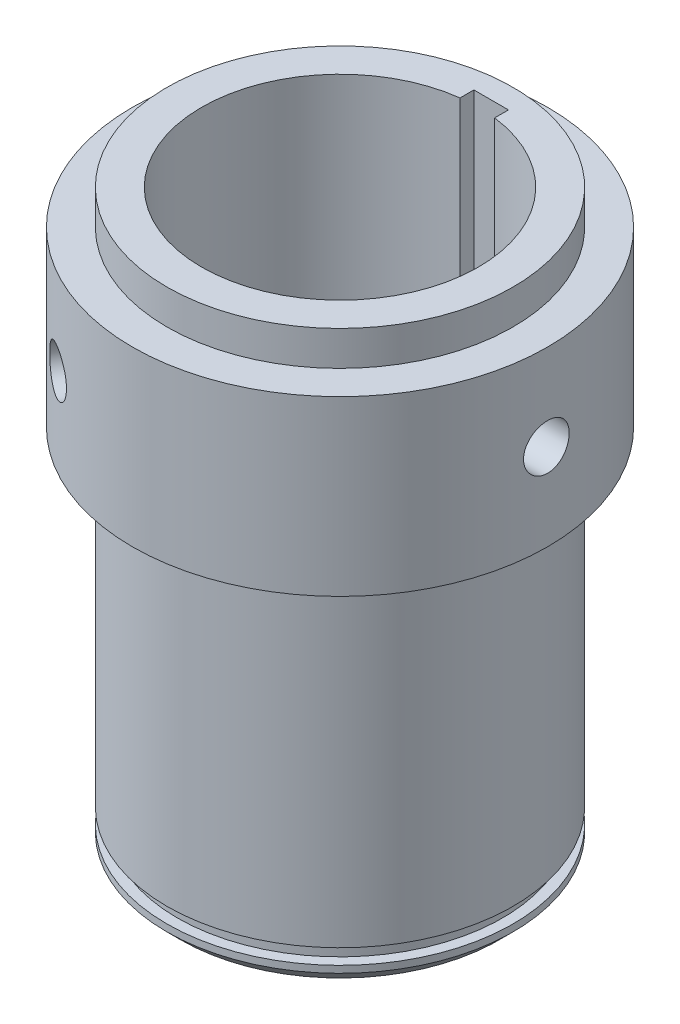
ISO-10303-21;
HEADER;
FILE_DESCRIPTION(('STEP AP214'),'2;1');
FILE_NAME('part.step','',(''),(''),'','','');
FILE_SCHEMA(('AUTOMOTIVE_DESIGN { 1 0 10303 214 1 1 1 1 }'));
ENDSEC;
DATA;
#1=APPLICATION_CONTEXT('core data for automotive mechanical design processes');
#2=APPLICATION_PROTOCOL_DEFINITION('international standard','automotive_design',2000,#1);
#3=PRODUCT_CONTEXT('',#1,'mechanical');
#4=PRODUCT('Part','Part','',(#3));
#5=PRODUCT_RELATED_PRODUCT_CATEGORY('part','',(#4));
#6=PRODUCT_DEFINITION_FORMATION('','',#4);
#7=PRODUCT_DEFINITION_CONTEXT('part definition',#1,'design');
#8=PRODUCT_DEFINITION('design','',#6,#7);
#9=PRODUCT_DEFINITION_SHAPE('','',#8);
#10=(LENGTH_UNIT() NAMED_UNIT(*) SI_UNIT(.MILLI.,.METRE.));
#11=(NAMED_UNIT(*) PLANE_ANGLE_UNIT() SI_UNIT($,.RADIAN.));
#12=(NAMED_UNIT(*) SI_UNIT($,.STERADIAN.) SOLID_ANGLE_UNIT());
#13=UNCERTAINTY_MEASURE_WITH_UNIT(LENGTH_MEASURE(1.E-05),#10,'distance_accuracy_value','');
#14=(GEOMETRIC_REPRESENTATION_CONTEXT(3) GLOBAL_UNCERTAINTY_ASSIGNED_CONTEXT((#13)) GLOBAL_UNIT_ASSIGNED_CONTEXT((#10,
#11,#12)) REPRESENTATION_CONTEXT('',''));
#15=CARTESIAN_POINT('',(0.,0.,0.));
#16=DIRECTION('',(0.,0.,1.));
#17=DIRECTION('',(1.,0.,0.));
#18=AXIS2_PLACEMENT_3D('',#15,#16,#17);
#19=CARTESIAN_POINT('',(25.,-45.9465840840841,0.));
#20=DIRECTION('',(0.,1.,0.));
#21=DIRECTION('',(0.,0.,1.));
#22=AXIS2_PLACEMENT_3D('',#19,#20,#21);
#23=PLANE('',#22);
#24=CARTESIAN_POINT('',(0.,-45.9465840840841,0.));
#25=DIRECTION('',(0.,1.,0.));
#26=DIRECTION('',(0.,0.,1.));
#27=AXIS2_PLACEMENT_3D('',#24,#25,#26);
#28=CIRCLE('',#27,25.);
#29=CARTESIAN_POINT('',(0.,-45.9465840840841,25.));
#30=VERTEX_POINT('',#29);
#31=EDGE_CURVE('E128',#30,#30,#28,.T.);
#32=ORIENTED_EDGE('',*,*,#31,.F.);
#33=EDGE_LOOP('',(#32));
#34=FACE_BOUND('',#33,.T.);
#35=CARTESIAN_POINT('',(0.,-45.9465840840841,0.));
#36=DIRECTION('',(0.,1.,0.));
#37=DIRECTION('',(0.,0.,1.));
#38=AXIS2_PLACEMENT_3D('',#35,#36,#37);
#39=CIRCLE('',#38,23.5);
#40=CARTESIAN_POINT('',(0.,-45.9465840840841,23.5));
#41=VERTEX_POINT('',#40);
#42=EDGE_CURVE('E336',#41,#41,#39,.T.);
#43=ORIENTED_EDGE('',*,*,#42,.T.);
#44=EDGE_LOOP('',(#43));
#45=FACE_BOUND('',#44,.T.);
#46=ADVANCED_FACE('F31',(#34,#45),#23,.F.);
#47=CARTESIAN_POINT('',(0.,69.8663413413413,0.));
#48=DIRECTION('',(0.,1.,0.));
#49=DIRECTION('',(0.,0.,1.));
#50=AXIS2_PLACEMENT_3D('',#47,#48,#49);
#51=CYLINDRICAL_SURFACE('',#50,25.);
#52=CARTESIAN_POINT('',(0.,1.55341591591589,0.));
#53=DIRECTION('',(0.,1.,0.));
#54=DIRECTION('',(0.,0.,1.));
#55=AXIS2_PLACEMENT_3D('',#52,#53,#54);
#56=CIRCLE('',#55,25.);
#57=CARTESIAN_POINT('',(0.,1.55341591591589,25.));
#58=VERTEX_POINT('',#57);
#59=EDGE_CURVE('E125',#58,#58,#56,.T.);
#60=ORIENTED_EDGE('',*,*,#59,.F.);
#61=EDGE_LOOP('',(#60));
#62=FACE_BOUND('',#61,.T.);
#63=ORIENTED_EDGE('',*,*,#31,.T.);
#64=EDGE_LOOP('',(#63));
#65=FACE_BOUND('',#64,.T.);
#66=ADVANCED_FACE('F195',(#62,#65),#51,.T.);
#67=CARTESIAN_POINT('',(25.,1.55341591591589,0.));
#68=DIRECTION('',(0.,1.,0.));
#69=DIRECTION('',(0.,0.,1.));
#70=AXIS2_PLACEMENT_3D('',#67,#68,#69);
#71=PLANE('',#70);
#72=CARTESIAN_POINT('',(0.,1.55341591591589,0.));
#73=DIRECTION('',(0.,1.,0.));
#74=DIRECTION('',(0.,0.,1.));
#75=AXIS2_PLACEMENT_3D('',#72,#73,#74);
#76=CIRCLE('',#75,30.);
#77=CARTESIAN_POINT('',(0.,1.55341591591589,30.));
#78=VERTEX_POINT('',#77);
#79=EDGE_CURVE('E122',#78,#78,#76,.T.);
#80=ORIENTED_EDGE('',*,*,#79,.F.);
#81=EDGE_LOOP('',(#80));
#82=FACE_BOUND('',#81,.T.);
#83=ORIENTED_EDGE('',*,*,#59,.T.);
#84=EDGE_LOOP('',(#83));
#85=FACE_BOUND('',#84,.T.);
#86=ADVANCED_FACE('F190',(#82,#85),#71,.F.);
#87=CARTESIAN_POINT('',(0.,69.8663413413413,0.));
#88=DIRECTION('',(0.,1.,0.));
#89=DIRECTION('',(0.,0.,1.));
#90=AXIS2_PLACEMENT_3D('',#87,#88,#89);
#91=CYLINDRICAL_SURFACE('',#90,30.);
#92=CARTESIAN_POINT('',(-17.7668576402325,14.0534159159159,-24.1731001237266));
#93=CARTESIAN_POINT('',(-17.7668519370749,13.8686560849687,-24.1731061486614));
#94=CARTESIAN_POINT('',(-17.7542425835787,13.6837765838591,-24.1823877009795));
#95=CARTESIAN_POINT('',(-17.7040634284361,13.3191506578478,-24.2191467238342));
#96=CARTESIAN_POINT('',(-17.6664666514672,13.1394099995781,-24.2466438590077));
#97=CARTESIAN_POINT('',(-17.5672126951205,12.7903944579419,-24.3186507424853));
#98=CARTESIAN_POINT('',(-17.5055707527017,12.6211130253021,-24.363149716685));
#99=CARTESIAN_POINT('',(-17.3596823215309,12.2976813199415,-24.4673133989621));
#100=CARTESIAN_POINT('',(-17.275440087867,12.1435282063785,-24.5269752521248));
#101=CARTESIAN_POINT('',(-17.0859462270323,11.8540209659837,-24.6593554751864));
#102=CARTESIAN_POINT('',(-16.9806141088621,11.7187423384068,-24.7321237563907));
#103=CARTESIAN_POINT('',(-16.7516564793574,11.4714750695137,-24.887770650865));
#104=CARTESIAN_POINT('',(-16.6280301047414,11.3594875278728,-24.9706497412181));
#105=CARTESIAN_POINT('',(-16.3651833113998,11.1617161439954,-25.1436981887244));
#106=CARTESIAN_POINT('',(-16.2259239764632,11.0759997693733,-25.2338855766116));
#107=CARTESIAN_POINT('',(-15.9356469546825,10.9336356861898,-25.418195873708));
#108=CARTESIAN_POINT('',(-15.7846296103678,10.8769871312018,-25.5123186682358));
#109=CARTESIAN_POINT('',(-15.47552421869,10.794589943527,-25.7009880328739));
#110=CARTESIAN_POINT('',(-15.3174674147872,10.7687166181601,-25.7955313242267));
#111=CARTESIAN_POINT('',(-14.9981162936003,10.7482182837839,-25.9825082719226));
#112=CARTESIAN_POINT('',(-14.8368220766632,10.753592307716,-26.0749419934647));
#113=CARTESIAN_POINT('',(-14.516338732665,10.7953353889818,-26.2547049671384));
#114=CARTESIAN_POINT('',(-14.3571435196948,10.8315703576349,-26.3420545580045));
#115=CARTESIAN_POINT('',(-14.0448109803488,10.9337975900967,-26.5098988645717));
#116=CARTESIAN_POINT('',(-13.89167374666,10.9997903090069,-26.5903934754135));
#117=CARTESIAN_POINT('',(-13.5957161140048,11.1598051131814,-26.7429300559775));
#118=CARTESIAN_POINT('',(-13.4529181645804,11.2538860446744,-26.8149538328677));
#119=CARTESIAN_POINT('',(-13.1823399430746,11.4673639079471,-26.949002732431));
#120=CARTESIAN_POINT('',(-13.0545602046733,11.5867617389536,-27.0110274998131));
#121=CARTESIAN_POINT('',(-12.8173587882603,11.8482371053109,-27.1243935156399));
#122=CARTESIAN_POINT('',(-12.708037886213,11.9904313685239,-27.1756764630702));
#123=CARTESIAN_POINT('',(-12.5120979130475,12.2930599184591,-27.2664464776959));
#124=CARTESIAN_POINT('',(-12.4254788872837,12.453494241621,-27.305933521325));
#125=CARTESIAN_POINT('',(-12.2777859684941,12.78814356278,-27.3726610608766));
#126=CARTESIAN_POINT('',(-12.2167192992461,12.9623624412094,-27.3998980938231));
#127=CARTESIAN_POINT('',(-12.1222487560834,13.319587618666,-27.4418253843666));
#128=CARTESIAN_POINT('',(-12.0888438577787,13.5025935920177,-27.4565161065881));
#129=CARTESIAN_POINT('',(-12.0509547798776,13.8711737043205,-27.4731673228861));
#130=CARTESIAN_POINT('',(-12.0463203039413,14.0567294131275,-27.4751939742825));
#131=CARTESIAN_POINT('',(-12.0657319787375,14.4260404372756,-27.4666747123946));
#132=CARTESIAN_POINT('',(-12.0897776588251,14.609795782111,-27.4561290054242));
#133=CARTESIAN_POINT('',(-12.1656185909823,14.9698091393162,-27.4226077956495));
#134=CARTESIAN_POINT('',(-12.2173423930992,15.1460852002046,-27.3996642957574));
#135=CARTESIAN_POINT('',(-12.3467464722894,15.4866985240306,-27.3415956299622));
#136=CARTESIAN_POINT('',(-12.4244274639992,15.6510354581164,-27.3064701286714));
#137=CARTESIAN_POINT('',(-12.6035591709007,15.9638476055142,-27.2242540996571));
#138=CARTESIAN_POINT('',(-12.705106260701,16.1122548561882,-27.1771149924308));
#139=CARTESIAN_POINT('',(-12.9285253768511,16.3883041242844,-27.0715433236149));
#140=CARTESIAN_POINT('',(-13.0503980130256,16.5159455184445,-27.0131104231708));
#141=CARTESIAN_POINT('',(-13.311215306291,16.7474066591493,-26.8855476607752));
#142=CARTESIAN_POINT('',(-13.4502323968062,16.8511196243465,-26.8163720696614));
#143=CARTESIAN_POINT('',(-13.7405989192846,17.0310435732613,-26.6687538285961));
#144=CARTESIAN_POINT('',(-13.8919481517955,17.1072550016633,-26.5903113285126));
#145=CARTESIAN_POINT('',(-14.2020318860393,17.2298332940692,-26.4259907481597));
#146=CARTESIAN_POINT('',(-14.3607499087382,17.2762636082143,-26.3401289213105));
#147=CARTESIAN_POINT('',(-14.6811273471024,17.3381685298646,-26.1629125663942));
#148=CARTESIAN_POINT('',(-14.8427866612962,17.3536442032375,-26.0715582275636));
#149=CARTESIAN_POINT('',(-15.163479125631,17.3531837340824,-25.8863479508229));
#150=CARTESIAN_POINT('',(-15.3225216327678,17.3374129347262,-25.7925077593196));
#151=CARTESIAN_POINT('',(-15.6344015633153,17.2752552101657,-25.6046605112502));
#152=CARTESIAN_POINT('',(-15.7872389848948,17.2288682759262,-25.5106534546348));
#153=CARTESIAN_POINT('',(-16.0825711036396,17.1068432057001,-25.3255069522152));
#154=CARTESIAN_POINT('',(-16.2250679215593,17.0312110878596,-25.2343669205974));
#155=CARTESIAN_POINT('',(-16.4960971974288,16.8528598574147,-25.0580316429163));
#156=CARTESIAN_POINT('',(-16.6246296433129,16.7501407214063,-24.9728364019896));
#157=CARTESIAN_POINT('',(-16.8651820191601,16.5199138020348,-24.8110215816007));
#158=CARTESIAN_POINT('',(-16.9771148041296,16.3922828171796,-24.7344477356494));
#159=CARTESIAN_POINT('',(-17.1810152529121,16.1161048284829,-24.5932539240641));
#160=CARTESIAN_POINT('',(-17.2729781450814,15.9675528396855,-24.5286368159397));
#161=CARTESIAN_POINT('',(-17.4349755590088,15.6532472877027,-24.4137573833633));
#162=CARTESIAN_POINT('',(-17.5049429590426,15.4874430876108,-24.3635390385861));
#163=CARTESIAN_POINT('',(-17.6208529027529,15.1438040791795,-24.279841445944));
#164=CARTESIAN_POINT('',(-17.6668221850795,14.9659829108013,-24.2463435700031));
#165=CARTESIAN_POINT('',(-17.7224023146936,14.6648909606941,-24.2057258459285));
#166=CARTESIAN_POINT('',(-17.7390537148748,14.5435361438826,-24.1935149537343));
#167=CARTESIAN_POINT('',(-17.7612832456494,14.2992771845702,-24.177200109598));
#168=CARTESIAN_POINT('',(-17.7668614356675,14.1763730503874,-24.1730961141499));
#169=CARTESIAN_POINT('',(-17.7668576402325,14.0534159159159,-24.1731001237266));
#170=B_SPLINE_CURVE_WITH_KNOTS('',3,(#92,#93,#94,#95,#96,#97,#98,#99,#100,#101,#102,#103,#104,
#105,#106,#107,#108,#109,#110,#111,#112,#113,#114,#115,#116,#117,#118,#119,#120,#121,#122,#123,
#124,#125,#126,#127,#128,#129,#130,#131,#132,#133,#134,#135,#136,#137,#138,#139,#140,#141,#142,
#143,#144,#145,#146,#147,#148,#149,#150,#151,#152,#153,#154,#155,#156,#157,#158,#159,#160,#161,
#162,#163,#164,#165,#166,#167,#168,#169),.UNSPECIFIED.,.T.,.F.,(4,2,2,2,2,2,2,2,2,2,2,2,2,2,2,2,
2,2,2,2,2,2,2,2,2,2,2,2,2,2,2,2,2,2,2,2,2,2,4),(0.,0.553830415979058,1.1082596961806,
1.6623382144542,2.21631248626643,2.77244278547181,3.32859933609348,3.88617242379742,
4.44372927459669,4.99901928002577,5.55429210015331,6.1071645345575,6.66004542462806,
7.21409285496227,7.76815996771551,8.32516051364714,8.88216217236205,9.43932119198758,
9.99645957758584,10.5506850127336,11.1049013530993,11.6576938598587,12.2105015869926,
12.7655811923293,13.3206774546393,13.8782049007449,14.4357233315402,14.992049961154,
15.5483574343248,16.1017290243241,16.6551007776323,17.2083587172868,17.7616171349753,
18.3176843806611,18.8738843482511,19.4317655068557,19.9890237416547,20.3575982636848,
20.7261708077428),.UNSPECIFIED.);
#171=CARTESIAN_POINT('',(-17.7668576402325,14.0534159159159,-24.1731001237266));
#172=VERTEX_POINT('',#171);
#173=EDGE_CURVE('E11',#172,#172,#170,.T.);
#174=ORIENTED_EDGE('',*,*,#173,.T.);
#175=EDGE_LOOP('',(#174));
#176=FACE_BOUND('',#175,.T.);
#177=CARTESIAN_POINT('',(-12.0510899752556,14.0534159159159,27.4731001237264));
#178=CARTESIAN_POINT('',(-12.051098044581,13.8686560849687,27.4730981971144));
#179=CARTESIAN_POINT('',(-12.0654407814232,13.6837765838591,27.4668189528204));
#180=CARTESIAN_POINT('',(-12.1223646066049,13.3191506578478,27.4417420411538));
#181=CARTESIAN_POINT('',(-12.1649762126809,13.1394099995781,27.4229308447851));
#182=CARTESIAN_POINT('',(-12.2769629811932,12.7903944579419,27.3729778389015));
#183=CARTESIAN_POINT('',(-12.3463211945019,12.6211130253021,27.3418438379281));
#184=CARTESIAN_POINT('',(-12.509473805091,12.2976813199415,27.2675825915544));
#185=CARTESIAN_POINT('',(-12.6032636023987,12.1435282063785,27.2244576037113));
#186=CARTESIAN_POINT('',(-12.812655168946,11.8540209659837,27.1265412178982));
#187=CARTESIAN_POINT('',(-12.9283404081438,11.7187423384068,27.0717050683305));
#188=CARTESIAN_POINT('',(-13.1776133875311,11.4714750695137,26.9512453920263));
#189=CARTESIAN_POINT('',(-13.3112019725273,11.3594875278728,26.8856213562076));
#190=CARTESIAN_POINT('',(-13.5924897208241,11.1617161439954,26.7445135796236));
#191=CARTESIAN_POINT('',(-13.7402239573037,11.0759997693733,26.669005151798));
#192=CARTESIAN_POINT('',(-14.0449798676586,10.9336356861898,26.5097730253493));
#193=CARTESIAN_POINT('',(-14.2020012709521,10.8769871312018,26.4260495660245));
#194=CARTESIAN_POINT('',(-14.5199464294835,10.794589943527,26.2526911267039));
#195=CARTESIAN_POINT('',(-14.6808517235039,10.7687166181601,26.1630815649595));
#196=CARTESIAN_POINT('',(-15.002454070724,10.7482182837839,25.9800038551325));
#197=CARTESIAN_POINT('',(-15.1631511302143,10.753592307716,25.8865358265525));
#198=CARTESIAN_POINT('',(-15.4790721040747,10.7953353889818,25.6988705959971));
#199=CARTESIAN_POINT('',(-15.63431667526,10.8315703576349,25.6046782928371));
#200=CARTESIAN_POINT('',(-15.9358403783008,10.9337975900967,25.4181125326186));
#201=CARTESIAN_POINT('',(-16.082119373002,10.9997903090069,25.3257391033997));
#202=CARTESIAN_POINT('',(-16.3621987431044,11.1598051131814,25.1457005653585));
#203=CARTESIAN_POINT('',(-16.49597213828,11.2538860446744,25.0580458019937));
#204=CARTESIAN_POINT('',(-16.7473510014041,11.4673639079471,24.8907426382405));
#205=CARTESIAN_POINT('',(-16.8649558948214,11.5867617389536,24.8110945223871));
#206=CARTESIAN_POINT('',(-17.0817344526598,11.8482371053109,24.6623550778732));
#207=CARTESIAN_POINT('',(-17.1808072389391,11.9904313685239,24.5933218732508));
#208=CARTESIAN_POINT('',(-17.3573863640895,12.2930599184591,24.4690178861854));
#209=CARTESIAN_POINT('',(-17.4348926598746,12.453494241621,24.4137471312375));
#210=CARTESIAN_POINT('',(-17.566526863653,12.78814356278,24.3192050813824));
#211=CARTESIAN_POINT('',(-17.6206481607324,12.9623624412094,24.2799383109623));
#212=CARTESIAN_POINT('',(-17.7041935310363,13.319587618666,24.2190880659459));
#213=CARTESIAN_POINT('',(-17.7336185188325,13.5025935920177,24.197503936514));
#214=CARTESIAN_POINT('',(-17.7669834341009,13.8711737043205,24.1730166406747));
#215=CARTESIAN_POINT('',(-17.771055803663,14.0567294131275,24.1700163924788));
#216=CARTESIAN_POINT('',(-17.7539720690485,14.4260404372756,24.1825677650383));
#217=CARTESIAN_POINT('',(-17.7328163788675,14.609795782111,24.1981190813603));
#218=CARTESIAN_POINT('',(-17.6658656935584,14.9698091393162,24.2470386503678));
#219=CARTESIAN_POINT('',(-17.6201341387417,15.1460852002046,24.2803610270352));
#220=CARTESIAN_POINT('',(-17.5051431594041,15.4866985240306,24.3633939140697));
#221=CARTESIAN_POINT('',(-17.4358830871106,15.6510354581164,24.4131048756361));
#222=CARTESIAN_POINT('',(-17.2751160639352,15.9638476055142,24.527129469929));
#223=CARTESIAN_POINT('',(-17.1835188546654,16.1122548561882,24.5915022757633));
#224=CARTESIAN_POINT('',(-16.9803815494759,16.3883041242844,24.7322030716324));
#225=CARTESIAN_POINT('',(-16.8688408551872,16.5159455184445,24.8085314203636));
#226=CARTESIAN_POINT('',(-16.627959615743,16.7474066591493,24.9706244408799));
#227=CARTESIAN_POINT('',(-16.498543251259,16.8511196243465,25.0564289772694));
#228=CARTESIAN_POINT('',(-16.2255188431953,17.0310435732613,25.2340846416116));
#229=CARTESIAN_POINT('',(-16.0819110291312,17.1072550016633,25.3259356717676));
#230=CARTESIAN_POINT('',(-15.7845633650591,17.2298332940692,25.5123157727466));
#231=CARTESIAN_POINT('',(-15.6308458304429,17.2762636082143,25.6068386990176));
#232=CARTESIAN_POINT('',(-15.3171832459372,17.3381685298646,25.7956855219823));
#233=CARTESIAN_POINT('',(-15.1572384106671,17.3536442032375,25.8900094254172));
#234=CARTESIAN_POINT('',(-14.8364953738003,17.3531837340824,26.075132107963));
#235=CARTESIAN_POINT('',(-14.6757061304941,17.3374129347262,26.1659468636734));
#236=CARTESIAN_POINT('',(-14.3570856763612,17.2752552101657,26.3421191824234));
#237=CARTESIAN_POINT('',(-14.1992544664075,17.2288682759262,26.4274767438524));
#238=CARTESIAN_POINT('',(-13.8912468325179,17.1068432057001,26.5906686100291));
#239=CARTESIAN_POINT('',(-13.7410688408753,17.0312110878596,26.6685044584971));
#240=CARTESIAN_POINT('',(-13.4528433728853,16.8528598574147,26.8150550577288));
#241=CARTESIAN_POINT('',(-13.3147959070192,16.7501407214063,26.8837698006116));
#242=CARTESIAN_POINT('',(-13.05438397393,16.5199138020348,27.0111868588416));
#243=CARTESIAN_POINT('',(-12.9321026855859,16.3922828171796,27.0698365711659));
#244=CARTESIAN_POINT('',(-12.7078750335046,16.1161048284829,27.1758226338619));
#245=CARTESIAN_POINT('',(-12.6059335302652,15.9675528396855,27.2231562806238));
#246=CARTESIAN_POINT('',(-12.425446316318,15.6532472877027,27.3060104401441));
#247=CARTESIAN_POINT('',(-12.346972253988,15.4874430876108,27.3414948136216));
#248=CARTESIAN_POINT('',(-12.2165330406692,15.1438040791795,27.4000269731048));
#249=CARTESIAN_POINT('',(-12.1645383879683,14.9659829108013,27.4230886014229));
#250=CARTESIAN_POINT('',(-12.1015723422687,14.6648909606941,27.4509135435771));
#251=CARTESIAN_POINT('',(-12.0826716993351,14.5435361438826,27.4592286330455));
#252=CARTESIAN_POINT('',(-12.0574278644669,14.2992771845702,27.4703225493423));
#253=CARTESIAN_POINT('',(-12.0510846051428,14.1763730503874,27.4731014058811));
#254=CARTESIAN_POINT('',(-12.0510899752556,14.0534159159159,27.4731001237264));
#255=B_SPLINE_CURVE_WITH_KNOTS('',3,(#177,#178,#179,#180,#181,#182,#183,#184,#185,#186,#187,
#188,#189,#190,#191,#192,#193,#194,#195,#196,#197,#198,#199,#200,#201,#202,#203,#204,#205,#206,
#207,#208,#209,#210,#211,#212,#213,#214,#215,#216,#217,#218,#219,#220,#221,#222,#223,#224,#225,
#226,#227,#228,#229,#230,#231,#232,#233,#234,#235,#236,#237,#238,#239,#240,#241,#242,#243,#244,
#245,#246,#247,#248,#249,#250,#251,#252,#253,#254),.UNSPECIFIED.,.T.,.F.,(4,2,2,2,2,2,2,2,2,2,2,
2,2,2,2,2,2,2,2,2,2,2,2,2,2,2,2,2,2,2,2,2,2,2,2,2,2,2,4),(0.,0.553830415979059,1.1082596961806,
1.6623382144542,2.21631248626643,2.77244278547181,3.32859933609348,3.88617242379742,
4.44372927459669,4.99901928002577,5.55429210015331,6.1071645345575,6.66004542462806,
7.21409285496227,7.76815996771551,8.32516051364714,8.88216217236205,9.43932119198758,
9.99645957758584,10.5506850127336,11.1049013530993,11.6576938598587,12.2105015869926,
12.7655811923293,13.3206774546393,13.8782049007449,14.4357233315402,14.992049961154,
15.5483574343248,16.1017290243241,16.6551007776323,17.2083587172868,17.7616171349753,
18.3176843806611,18.8738843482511,19.4317655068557,19.9890237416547,20.3575982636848,
20.7261708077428),.UNSPECIFIED.);
#256=CARTESIAN_POINT('',(-12.0510899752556,14.0534159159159,27.4731001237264));
#257=VERTEX_POINT('',#256);
#258=EDGE_CURVE('E43',#257,#257,#255,.T.);
#259=ORIENTED_EDGE('',*,*,#258,.T.);
#260=EDGE_LOOP('',(#259));
#261=FACE_BOUND('',#260,.T.);
#262=CARTESIAN_POINT('',(29.8179476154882,14.0534159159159,-3.29999999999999));
#263=CARTESIAN_POINT('',(29.817949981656,13.8686560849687,-3.29999204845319));
#264=CARTESIAN_POINT('',(29.819683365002,13.6837765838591,-3.28443125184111));
#265=CARTESIAN_POINT('',(29.8264280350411,13.3191506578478,-3.22259531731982));
#266=CARTESIAN_POINT('',(29.8314428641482,13.1394099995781,-3.17628698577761));
#267=CARTESIAN_POINT('',(29.8441756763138,12.7903944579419,-3.05432709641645));
#268=CARTESIAN_POINT('',(29.8518919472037,12.6211130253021,-2.97869412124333));
#269=CARTESIAN_POINT('',(29.8691561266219,12.2976813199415,-2.80026919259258));
#270=CARTESIAN_POINT('',(29.8787036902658,12.1435282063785,-2.69748235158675));
#271=CARTESIAN_POINT('',(29.8986013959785,11.8540209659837,-2.46718574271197));
#272=CARTESIAN_POINT('',(29.908954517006,11.7187423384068,-2.33958131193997));
#273=CARTESIAN_POINT('',(29.9292698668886,11.4714750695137,-2.06347474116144));
#274=CARTESIAN_POINT('',(29.9392320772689,11.3594875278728,-1.91497161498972));
#275=CARTESIAN_POINT('',(29.957673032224,11.1617161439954,-1.60081539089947));
#276=CARTESIAN_POINT('',(29.9661479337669,11.0759997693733,-1.43511957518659));
#277=CARTESIAN_POINT('',(29.9806268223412,10.9336356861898,-1.09157715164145));
#278=CARTESIAN_POINT('',(29.98663088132,10.8769871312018,-0.913730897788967));
#279=CARTESIAN_POINT('',(29.9954706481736,10.794589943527,-0.551703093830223));
#280=CARTESIAN_POINT('',(29.9983191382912,10.7687166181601,-0.367550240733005));
#281=CARTESIAN_POINT('',(30.0005703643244,10.7482182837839,0.00250441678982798));
#282=CARTESIAN_POINT('',(29.9999732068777,10.753592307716,0.188406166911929));
#283=CARTESIAN_POINT('',(29.9954108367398,10.7953353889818,0.555834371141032));
#284=CARTESIAN_POINT('',(29.9914601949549,10.8315703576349,0.737376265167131));
#285=CARTESIAN_POINT('',(29.9806513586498,10.9337975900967,1.09178633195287));
#286=CARTESIAN_POINT('',(29.9737931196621,10.9997903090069,1.2646543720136));
#287=CARTESIAN_POINT('',(29.9579148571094,11.1598051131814,1.59722949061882));
#288=CARTESIAN_POINT('',(29.9488903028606,11.2538860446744,1.75690803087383));
#289=CARTESIAN_POINT('',(29.9296909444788,11.4673639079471,2.05826009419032));
#290=CARTESIAN_POINT('',(29.9195160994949,11.5867617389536,2.19993297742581));
#291=CARTESIAN_POINT('',(29.8990932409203,11.8482371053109,2.46203843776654));
#292=CARTESIAN_POINT('',(29.8888451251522,11.9904313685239,2.5823545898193));
#293=CARTESIAN_POINT('',(29.8694842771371,12.2930599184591,2.79742859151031));
#294=CARTESIAN_POINT('',(29.8603715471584,12.453494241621,2.89218639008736));
#295=CARTESIAN_POINT('',(29.8443128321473,12.78814356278,3.05345597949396));
#296=CARTESIAN_POINT('',(29.8373674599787,12.9623624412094,3.11995978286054));
#297=CARTESIAN_POINT('',(29.8264422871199,13.319587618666,3.22273731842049));
#298=CARTESIAN_POINT('',(29.8224623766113,13.5025935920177,3.25901217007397));
#299=CARTESIAN_POINT('',(29.8179382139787,13.8711737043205,3.30015068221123));
#300=CARTESIAN_POINT('',(29.8173761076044,14.0567294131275,3.30517758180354));
#301=CARTESIAN_POINT('',(29.8197040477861,14.4260404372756,3.28410694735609));
#302=CARTESIAN_POINT('',(29.8225940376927,14.609795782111,3.25800992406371));
#303=CARTESIAN_POINT('',(29.8314842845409,14.9698091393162,3.17556914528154));
#304=CARTESIAN_POINT('',(29.837476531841,15.1460852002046,3.11930326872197));
#305=CARTESIAN_POINT('',(29.8518896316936,15.4866985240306,2.9782017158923));
#306=CARTESIAN_POINT('',(29.8603105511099,15.6510354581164,2.89336525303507));
#307=CARTESIAN_POINT('',(29.8786752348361,15.9638476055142,2.69712462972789));
#308=CARTESIAN_POINT('',(29.8886251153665,16.1122548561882,2.58561271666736));
#309=CARTESIAN_POINT('',(29.9089069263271,16.3883041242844,2.33934025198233));
#310=CARTESIAN_POINT('',(29.9192388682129,16.5159455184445,2.20457900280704));
#311=CARTESIAN_POINT('',(29.9391749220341,16.7474066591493,1.91492321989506));
#312=CARTESIAN_POINT('',(29.9487756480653,16.8511196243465,1.75994309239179));
#313=CARTESIAN_POINT('',(29.9661177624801,17.0310435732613,1.43466918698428));
#314=CARTESIAN_POINT('',(29.9738591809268,17.1072550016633,1.2643756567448));
#315=CARTESIAN_POINT('',(29.9865952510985,17.2298332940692,0.913674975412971));
#316=CARTESIAN_POINT('',(29.9915957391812,17.2762636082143,0.73329022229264));
#317=CARTESIAN_POINT('',(29.9983105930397,17.3381685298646,0.367227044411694));
#318=CARTESIAN_POINT('',(30.0000250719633,17.3536442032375,0.181548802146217));
#319=CARTESIAN_POINT('',(29.9999744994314,17.3531837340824,-0.188784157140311));
#320=CARTESIAN_POINT('',(29.9982277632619,17.3374129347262,-0.373439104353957));
#321=CARTESIAN_POINT('',(29.9914872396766,17.2752552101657,-0.737458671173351));
#322=CARTESIAN_POINT('',(29.9864934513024,17.2288682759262,-0.916823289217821));
#323=CARTESIAN_POINT('',(29.9738179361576,17.1068432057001,-1.26516165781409));
#324=CARTESIAN_POINT('',(29.9661367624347,17.0312110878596,-1.43413753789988));
#325=CARTESIAN_POINT('',(29.9489405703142,16.8528598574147,-1.75702341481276));
#326=CARTESIAN_POINT('',(29.9394255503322,16.7501407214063,-1.91093339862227));
#327=CARTESIAN_POINT('',(29.9195659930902,16.5199138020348,-2.20016527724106));
#328=CARTESIAN_POINT('',(29.9092174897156,16.3922828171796,-2.33538883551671));
#329=CARTESIAN_POINT('',(29.8888902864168,16.1161048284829,-2.58256870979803));
#330=CARTESIAN_POINT('',(29.8789116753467,15.9675528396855,-2.69451946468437));
#331=CARTESIAN_POINT('',(29.8604218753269,15.6532472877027,-2.89225305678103));
#332=CARTESIAN_POINT('',(29.8519152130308,15.4874430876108,-2.9779557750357));
#333=CARTESIAN_POINT('',(29.8373859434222,15.1438040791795,-3.12018552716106));
#334=CARTESIAN_POINT('',(29.8313605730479,14.9659829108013,-3.17674503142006));
#335=CARTESIAN_POINT('',(29.8239746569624,14.6648909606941,-3.24518769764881));
#336=CARTESIAN_POINT('',(29.82172541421,14.5435361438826,-3.26571367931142));
#337=CARTESIAN_POINT('',(29.8187111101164,14.2992771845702,-3.29312243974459));
#338=CARTESIAN_POINT('',(29.8179460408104,14.1763730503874,-3.30000529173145));
#339=CARTESIAN_POINT('',(29.8179476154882,14.0534159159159,-3.29999999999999));
#340=B_SPLINE_CURVE_WITH_KNOTS('',3,(#262,#263,#264,#265,#266,#267,#268,#269,#270,#271,#272,
#273,#274,#275,#276,#277,#278,#279,#280,#281,#282,#283,#284,#285,#286,#287,#288,#289,#290,#291,
#292,#293,#294,#295,#296,#297,#298,#299,#300,#301,#302,#303,#304,#305,#306,#307,#308,#309,#310,
#311,#312,#313,#314,#315,#316,#317,#318,#319,#320,#321,#322,#323,#324,#325,#326,#327,#328,#329,
#330,#331,#332,#333,#334,#335,#336,#337,#338,#339),.UNSPECIFIED.,.T.,.F.,(4,2,2,2,2,2,2,2,2,2,2,
2,2,2,2,2,2,2,2,2,2,2,2,2,2,2,2,2,2,2,2,2,2,2,2,2,2,2,4),(0.,0.553830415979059,1.1082596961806,
1.6623382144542,2.21631248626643,2.77244278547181,3.32859933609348,3.88617242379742,
4.44372927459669,4.99901928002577,5.55429210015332,6.1071645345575,6.66004542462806,
7.21409285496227,7.76815996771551,8.32516051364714,8.88216217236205,9.43932119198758,
9.99645957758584,10.5506850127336,11.1049013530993,11.6576938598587,12.2105015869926,
12.7655811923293,13.3206774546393,13.8782049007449,14.4357233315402,14.992049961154,
15.5483574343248,16.1017290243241,16.6551007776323,17.2083587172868,17.7616171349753,
18.3176843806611,18.8738843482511,19.4317655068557,19.9890237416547,20.3575982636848,
20.7261708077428),.UNSPECIFIED.);
#341=CARTESIAN_POINT('',(29.8179476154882,14.0534159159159,-3.29999999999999));
#342=VERTEX_POINT('',#341);
#343=EDGE_CURVE('E137',#342,#342,#340,.T.);
#344=ORIENTED_EDGE('',*,*,#343,.T.);
#345=EDGE_LOOP('',(#344));
#346=FACE_BOUND('',#345,.T.);
#347=CARTESIAN_POINT('',(0.,26.5534159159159,0.));
#348=DIRECTION('',(0.,1.,0.));
#349=DIRECTION('',(0.,0.,1.));
#350=AXIS2_PLACEMENT_3D('',#347,#348,#349);
#351=CIRCLE('',#350,30.);
#352=CARTESIAN_POINT('',(0.,26.5534159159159,30.));
#353=VERTEX_POINT('',#352);
#354=EDGE_CURVE('E119',#353,#353,#351,.T.);
#355=ORIENTED_EDGE('',*,*,#354,.F.);
#356=EDGE_LOOP('',(#355));
#357=FACE_BOUND('',#356,.T.);
#358=ORIENTED_EDGE('',*,*,#79,.T.);
#359=EDGE_LOOP('',(#358));
#360=FACE_BOUND('',#359,.T.);
#361=ADVANCED_FACE('F145',(#176,#261,#346,#357,#360),#91,.T.);
#362=CARTESIAN_POINT('',(30.,26.5534159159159,0.));
#363=DIRECTION('',(0.,-1.,0.));
#364=DIRECTION('',(0.,0.,-1.));
#365=AXIS2_PLACEMENT_3D('',#362,#363,#364);
#366=PLANE('',#365);
#367=CARTESIAN_POINT('',(0.,26.5534159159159,0.));
#368=DIRECTION('',(0.,1.,0.));
#369=DIRECTION('',(0.,0.,1.));
#370=AXIS2_PLACEMENT_3D('',#367,#368,#369);
#371=CIRCLE('',#370,25.);
#372=CARTESIAN_POINT('',(0.,26.5534159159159,25.));
#373=VERTEX_POINT('',#372);
#374=EDGE_CURVE('E116',#373,#373,#371,.T.);
#375=ORIENTED_EDGE('',*,*,#374,.F.);
#376=EDGE_LOOP('',(#375));
#377=FACE_BOUND('',#376,.T.);
#378=ORIENTED_EDGE('',*,*,#354,.T.);
#379=EDGE_LOOP('',(#378));
#380=FACE_BOUND('',#379,.T.);
#381=ADVANCED_FACE('F183',(#377,#380),#366,.F.);
#382=CARTESIAN_POINT('',(0.,69.8663413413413,0.));
#383=DIRECTION('',(0.,1.,0.));
#384=DIRECTION('',(0.,0.,1.));
#385=AXIS2_PLACEMENT_3D('',#382,#383,#384);
#386=CYLINDRICAL_SURFACE('',#385,25.);
#387=CARTESIAN_POINT('',(0.,31.5534159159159,0.));
#388=DIRECTION('',(0.,1.,0.));
#389=DIRECTION('',(0.,0.,1.));
#390=AXIS2_PLACEMENT_3D('',#387,#388,#389);
#391=CIRCLE('',#390,25.);
#392=CARTESIAN_POINT('',(0.,31.5534159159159,25.));
#393=VERTEX_POINT('',#392);
#394=EDGE_CURVE('E107',#393,#393,#391,.T.);
#395=ORIENTED_EDGE('',*,*,#394,.F.);
#396=EDGE_LOOP('',(#395));
#397=FACE_BOUND('',#396,.T.);
#398=ORIENTED_EDGE('',*,*,#374,.T.);
#399=EDGE_LOOP('',(#398));
#400=FACE_BOUND('',#399,.T.);
#401=ADVANCED_FACE('F180',(#397,#400),#386,.T.);
#402=CARTESIAN_POINT('',(25.,31.5534159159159,0.));
#403=DIRECTION('',(0.,-1.,0.));
#404=DIRECTION('',(0.,0.,-1.));
#405=AXIS2_PLACEMENT_3D('',#402,#403,#404);
#406=PLANE('',#405);
#407=CARTESIAN_POINT('',(0.,31.5534159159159,0.));
#408=DIRECTION('',(0.,1.,0.));
#409=DIRECTION('',(0.,0.,1.));
#410=AXIS2_PLACEMENT_3D('',#407,#408,#409);
#411=CIRCLE('',#410,20.);
#412=CARTESIAN_POINT('',(-2.5,31.5534159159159,-19.8431348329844));
#413=VERTEX_POINT('',#412);
#414=CARTESIAN_POINT('',(2.5,31.5534159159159,-19.8431348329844));
#415=VERTEX_POINT('',#414);
#416=EDGE_CURVE('E104',#413,#415,#411,.T.);
#417=ORIENTED_EDGE('',*,*,#416,.F.);
#418=DIRECTION('',(0.,0.,1.));
#419=VECTOR('',#418,1.);
#420=CARTESIAN_POINT('',(-2.5,31.5534159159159,-19.8431348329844));
#421=LINE('',#420,#419);
#422=CARTESIAN_POINT('',(-2.5,31.5534159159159,-21.8431348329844));
#423=VERTEX_POINT('',#422);
#424=EDGE_CURVE('E87',#423,#413,#421,.T.);
#425=ORIENTED_EDGE('',*,*,#424,.F.);
#426=DIRECTION('',(-1.,0.,0.));
#427=VECTOR('',#426,1.);
#428=CARTESIAN_POINT('',(-2.5,31.5534159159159,-21.8431348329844));
#429=LINE('',#428,#427);
#430=CARTESIAN_POINT('',(2.5,31.5534159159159,-21.8431348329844));
#431=VERTEX_POINT('',#430);
#432=EDGE_CURVE('E100',#431,#423,#429,.T.);
#433=ORIENTED_EDGE('',*,*,#432,.F.);
#434=DIRECTION('',(0.,0.,-1.));
#435=VECTOR('',#434,1.);
#436=CARTESIAN_POINT('',(2.5,31.5534159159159,-19.8431348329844));
#437=LINE('',#436,#435);
#438=EDGE_CURVE('E314',#415,#431,#437,.T.);
#439=ORIENTED_EDGE('',*,*,#438,.F.);
#440=EDGE_LOOP('',(#417,#425,#433,#439));
#441=FACE_BOUND('',#440,.T.);
#442=ORIENTED_EDGE('',*,*,#394,.T.);
#443=EDGE_LOOP('',(#442));
#444=FACE_BOUND('',#443,.T.);
#445=ADVANCED_FACE('F177',(#441,#444),#406,.F.);
#446=CARTESIAN_POINT('',(0.,69.8663413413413,0.));
#447=DIRECTION('',(0.,1.,0.));
#448=DIRECTION('',(0.,0.,1.));
#449=AXIS2_PLACEMENT_3D('',#446,#447,#448);
#450=CYLINDRICAL_SURFACE('',#449,20.);
#451=ORIENTED_EDGE('',*,*,#416,.T.);
#452=DIRECTION('',(0.,1.,0.));
#453=VECTOR('',#452,1.);
#454=CARTESIAN_POINT('',(2.5,-51.1465840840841,-19.8431348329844));
#455=LINE('',#454,#453);
#456=CARTESIAN_POINT('',(2.5,-51.1465840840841,-19.8431348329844));
#457=VERTEX_POINT('',#456);
#458=EDGE_CURVE('E92',#457,#415,#455,.T.);
#459=ORIENTED_EDGE('',*,*,#458,.F.);
#460=CARTESIAN_POINT('',(0.,-51.1465840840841,0.));
#461=DIRECTION('',(0.,1.,0.));
#462=DIRECTION('',(0.,0.,1.));
#463=AXIS2_PLACEMENT_3D('',#460,#461,#462);
#464=CIRCLE('',#463,20.);
#465=CARTESIAN_POINT('',(-2.5,-51.1465840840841,-19.8431348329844));
#466=VERTEX_POINT('',#465);
#467=EDGE_CURVE('E98',#466,#457,#464,.T.);
#468=ORIENTED_EDGE('',*,*,#467,.F.);
#469=DIRECTION('',(0.,1.,0.));
#470=VECTOR('',#469,1.);
#471=CARTESIAN_POINT('',(-2.5,-51.1465840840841,-19.8431348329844));
#472=LINE('',#471,#470);
#473=EDGE_CURVE('E82',#466,#413,#472,.T.);
#474=ORIENTED_EDGE('',*,*,#473,.T.);
#475=EDGE_LOOP('',(#451,#459,#468,#474));
#476=FACE_BOUND('',#475,.T.);
#477=ADVANCED_FACE('F103',(#476),#450,.F.);
#478=CARTESIAN_POINT('',(20.,-51.1465840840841,0.));
#479=DIRECTION('',(0.,1.,0.));
#480=DIRECTION('',(0.,0.,1.));
#481=AXIS2_PLACEMENT_3D('',#478,#479,#480);
#482=PLANE('',#481);
#483=CARTESIAN_POINT('',(0.,-51.1465840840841,0.));
#484=DIRECTION('',(0.,1.,0.));
#485=DIRECTION('',(0.,0.,1.));
#486=AXIS2_PLACEMENT_3D('',#483,#484,#485);
#487=CIRCLE('',#486,23.);
#488=CARTESIAN_POINT('',(0.,-51.1465840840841,23.));
#489=VERTEX_POINT('',#488);
#490=EDGE_CURVE('E134',#489,#489,#487,.F.);
#491=ORIENTED_EDGE('',*,*,#490,.T.);
#492=EDGE_LOOP('',(#491));
#493=FACE_BOUND('',#492,.T.);
#494=DIRECTION('',(-1.,0.,0.));
#495=VECTOR('',#494,1.);
#496=CARTESIAN_POINT('',(-2.5,-51.1465840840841,-21.8431348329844));
#497=LINE('',#496,#495);
#498=CARTESIAN_POINT('',(2.5,-51.1465840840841,-21.8431348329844));
#499=VERTEX_POINT('',#498);
#500=CARTESIAN_POINT('',(-2.5,-51.1465840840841,-21.8431348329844));
#501=VERTEX_POINT('',#500);
#502=EDGE_CURVE('E50',#499,#501,#497,.T.);
#503=ORIENTED_EDGE('',*,*,#502,.T.);
#504=DIRECTION('',(0.,0.,1.));
#505=VECTOR('',#504,1.);
#506=CARTESIAN_POINT('',(-2.5,-51.1465840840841,-19.8431348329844));
#507=LINE('',#506,#505);
#508=EDGE_CURVE('E85',#501,#466,#507,.T.);
#509=ORIENTED_EDGE('',*,*,#508,.T.);
#510=ORIENTED_EDGE('',*,*,#467,.T.);
#511=DIRECTION('',(0.,0.,-1.));
#512=VECTOR('',#511,1.);
#513=CARTESIAN_POINT('',(2.5,-51.1465840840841,-19.8431348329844));
#514=LINE('',#513,#512);
#515=EDGE_CURVE('E99',#457,#499,#514,.T.);
#516=ORIENTED_EDGE('',*,*,#515,.T.);
#517=EDGE_LOOP('',(#503,#509,#510,#516));
#518=FACE_BOUND('',#517,.T.);
#519=ADVANCED_FACE('F96',(#493,#518),#482,.F.);
#520=CARTESIAN_POINT('',(0.,69.8663413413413,0.));
#521=DIRECTION('',(0.,1.,0.));
#522=DIRECTION('',(0.,0.,1.));
#523=AXIS2_PLACEMENT_3D('',#520,#521,#522);
#524=CYLINDRICAL_SURFACE('',#523,25.);
#525=CARTESIAN_POINT('',(0.,-49.1465840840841,0.));
#526=DIRECTION('',(0.,1.,0.));
#527=DIRECTION('',(0.,0.,1.));
#528=AXIS2_PLACEMENT_3D('',#525,#526,#527);
#529=CIRCLE('',#528,25.);
#530=CARTESIAN_POINT('',(0.,-49.1465840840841,25.));
#531=VERTEX_POINT('',#530);
#532=EDGE_CURVE('E131',#531,#531,#529,.T.);
#533=ORIENTED_EDGE('',*,*,#532,.T.);
#534=EDGE_LOOP('',(#533));
#535=FACE_BOUND('',#534,.T.);
#536=CARTESIAN_POINT('',(0.,-48.1465840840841,0.));
#537=DIRECTION('',(0.,1.,0.));
#538=DIRECTION('',(0.,0.,1.));
#539=AXIS2_PLACEMENT_3D('',#536,#537,#538);
#540=CIRCLE('',#539,25.);
#541=CARTESIAN_POINT('',(0.,-48.1465840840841,25.));
#542=VERTEX_POINT('',#541);
#543=EDGE_CURVE('E105',#542,#542,#540,.T.);
#544=ORIENTED_EDGE('',*,*,#543,.F.);
#545=EDGE_LOOP('',(#544));
#546=FACE_BOUND('',#545,.T.);
#547=ADVANCED_FACE('F167',(#535,#546),#524,.T.);
#548=CARTESIAN_POINT('',(23.5,-48.1465840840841,0.));
#549=DIRECTION('',(0.,-1.,0.));
#550=DIRECTION('',(0.,0.,-1.));
#551=AXIS2_PLACEMENT_3D('',#548,#549,#550);
#552=PLANE('',#551);
#553=CARTESIAN_POINT('',(0.,-48.1465840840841,0.));
#554=DIRECTION('',(0.,1.,0.));
#555=DIRECTION('',(0.,0.,1.));
#556=AXIS2_PLACEMENT_3D('',#553,#554,#555);
#557=CIRCLE('',#556,23.5);
#558=CARTESIAN_POINT('',(0.,-48.1465840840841,23.5));
#559=VERTEX_POINT('',#558);
#560=EDGE_CURVE('E110',#559,#559,#557,.T.);
#561=ORIENTED_EDGE('',*,*,#560,.F.);
#562=EDGE_LOOP('',(#561));
#563=FACE_BOUND('',#562,.T.);
#564=ORIENTED_EDGE('',*,*,#543,.T.);
#565=EDGE_LOOP('',(#564));
#566=FACE_BOUND('',#565,.T.);
#567=ADVANCED_FACE('F163',(#563,#566),#552,.F.);
#568=CARTESIAN_POINT('',(0.,69.8663413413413,0.));
#569=DIRECTION('',(0.,1.,0.));
#570=DIRECTION('',(0.,0.,1.));
#571=AXIS2_PLACEMENT_3D('',#568,#569,#570);
#572=CYLINDRICAL_SURFACE('',#571,23.5);
#573=ORIENTED_EDGE('',*,*,#42,.F.);
#574=EDGE_LOOP('',(#573));
#575=FACE_BOUND('',#574,.T.);
#576=ORIENTED_EDGE('',*,*,#560,.T.);
#577=EDGE_LOOP('',(#576));
#578=FACE_BOUND('',#577,.T.);
#579=ADVANCED_FACE('F160',(#575,#578),#572,.T.);
#580=CARTESIAN_POINT('',(0.,-49.1465840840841,0.));
#581=DIRECTION('',(0.,1.,0.));
#582=DIRECTION('',(0.,0.,1.));
#583=AXIS2_PLACEMENT_3D('',#580,#581,#582);
#584=CONICAL_SURFACE('',#583,25.,0.785398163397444);
#585=ORIENTED_EDGE('',*,*,#490,.F.);
#586=EDGE_LOOP('',(#585));
#587=FACE_BOUND('',#586,.T.);
#588=ORIENTED_EDGE('',*,*,#532,.F.);
#589=EDGE_LOOP('',(#588));
#590=FACE_BOUND('',#589,.T.);
#591=ADVANCED_FACE('F33',(#587,#590),#584,.T.);
#592=CARTESIAN_POINT('',(30.,14.0534159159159,0.));
#593=DIRECTION('',(1.,0.,0.));
#594=DIRECTION('',(0.,0.,-1.));
#595=AXIS2_PLACEMENT_3D('',#592,#593,#594);
#596=CYLINDRICAL_SURFACE('',#595,3.29999999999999);
#597=CARTESIAN_POINT('',(23.,14.0534159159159,0.));
#598=DIRECTION('',(1.,0.,0.));
#599=DIRECTION('',(0.,0.,-1.));
#600=AXIS2_PLACEMENT_3D('',#597,#598,#599);
#601=CIRCLE('',#600,3.3);
#602=CARTESIAN_POINT('',(23.,14.0534159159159,-3.3));
#603=VERTEX_POINT('',#602);
#604=EDGE_CURVE('E333',#603,#603,#601,.T.);
#605=ORIENTED_EDGE('',*,*,#604,.F.);
#606=EDGE_LOOP('',(#605));
#607=FACE_BOUND('',#606,.T.);
#608=ORIENTED_EDGE('',*,*,#343,.F.);
#609=EDGE_LOOP('',(#608));
#610=FACE_BOUND('',#609,.T.);
#611=ADVANCED_FACE('F149',(#607,#610),#596,.F.);
#612=CARTESIAN_POINT('',(23.,14.0534159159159,0.));
#613=DIRECTION('',(1.,0.,0.));
#614=DIRECTION('',(0.,0.,-1.));
#615=AXIS2_PLACEMENT_3D('',#612,#613,#614);
#616=CONICAL_SURFACE('',#615,3.3,1.02974425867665);
#617=CARTESIAN_POINT('',(21.0171599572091,14.0534159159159,0.));
#618=VERTEX_POINT('',#617);
#619=VERTEX_LOOP('',#618);
#620=FACE_BOUND('',#619,.T.);
#621=ORIENTED_EDGE('',*,*,#604,.T.);
#622=EDGE_LOOP('',(#621));
#623=FACE_BOUND('',#622,.T.);
#624=ADVANCED_FACE('F154',(#620,#623),#616,.F.);
#625=CARTESIAN_POINT('',(-15.0000000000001,14.0534159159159,25.9807621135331));
#626=DIRECTION('',(-0.500000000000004,0.,0.866025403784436));
#627=DIRECTION('',(0.866025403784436,0.,0.500000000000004));
#628=AXIS2_PLACEMENT_3D('',#625,#626,#627);
#629=CYLINDRICAL_SURFACE('',#628,3.29999999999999);
#630=CARTESIAN_POINT('',(-11.5000000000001,14.0534159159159,19.918584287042));
#631=DIRECTION('',(-0.500000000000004,0.,0.866025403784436));
#632=DIRECTION('',(0.866025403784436,0.,0.500000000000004));
#633=AXIS2_PLACEMENT_3D('',#630,#631,#632);
#634=CIRCLE('',#633,3.3);
#635=CARTESIAN_POINT('',(-8.64211616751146,14.0534159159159,21.5685842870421));
#636=VERTEX_POINT('',#635);
#637=EDGE_CURVE('E330',#636,#636,#634,.T.);
#638=ORIENTED_EDGE('',*,*,#637,.F.);
#639=EDGE_LOOP('',(#638));
#640=FACE_BOUND('',#639,.T.);
#641=ORIENTED_EDGE('',*,*,#258,.F.);
#642=EDGE_LOOP('',(#641));
#643=FACE_BOUND('',#642,.T.);
#644=ADVANCED_FACE('F159',(#640,#643),#629,.F.);
#645=CARTESIAN_POINT('',(-11.5000000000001,14.0534159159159,19.918584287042));
#646=DIRECTION('',(-0.500000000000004,0.,0.866025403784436));
#647=DIRECTION('',(0.866025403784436,0.,0.500000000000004));
#648=AXIS2_PLACEMENT_3D('',#645,#646,#647);
#649=CONICAL_SURFACE('',#648,3.3,1.02974425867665);
#650=CARTESIAN_POINT('',(-10.5085799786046,14.0534159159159,18.2013944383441));
#651=VERTEX_POINT('',#650);
#652=VERTEX_LOOP('',#651);
#653=FACE_BOUND('',#652,.T.);
#654=ORIENTED_EDGE('',*,*,#637,.T.);
#655=EDGE_LOOP('',(#654));
#656=FACE_BOUND('',#655,.T.);
#657=ADVANCED_FACE('F156',(#653,#656),#649,.F.);
#658=CARTESIAN_POINT('',(-14.9999999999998,14.0534159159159,-25.9807621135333));
#659=DIRECTION('',(-0.499999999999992,0.,-0.866025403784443));
#660=DIRECTION('',(-0.866025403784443,0.,0.499999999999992));
#661=AXIS2_PLACEMENT_3D('',#658,#659,#660);
#662=CYLINDRICAL_SURFACE('',#661,3.29999999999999);
#663=CARTESIAN_POINT('',(-11.4999999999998,14.0534159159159,-19.9185842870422));
#664=DIRECTION('',(-0.499999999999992,0.,-0.866025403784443));
#665=DIRECTION('',(-0.866025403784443,0.,0.499999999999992));
#666=AXIS2_PLACEMENT_3D('',#663,#664,#665);
#667=CIRCLE('',#666,3.3);
#668=CARTESIAN_POINT('',(-14.3578838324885,14.0534159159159,-18.2685842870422));
#669=VERTEX_POINT('',#668);
#670=EDGE_CURVE('E325',#669,#669,#667,.T.);
#671=ORIENTED_EDGE('',*,*,#670,.F.);
#672=EDGE_LOOP('',(#671));
#673=FACE_BOUND('',#672,.T.);
#674=ORIENTED_EDGE('',*,*,#173,.F.);
#675=EDGE_LOOP('',(#674));
#676=FACE_BOUND('',#675,.T.);
#677=ADVANCED_FACE('F241',(#673,#676),#662,.F.);
#678=CARTESIAN_POINT('',(-11.4999999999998,14.0534159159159,-19.9185842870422));
#679=DIRECTION('',(-0.499999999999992,0.,-0.866025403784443));
#680=DIRECTION('',(-0.866025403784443,0.,0.499999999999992));
#681=AXIS2_PLACEMENT_3D('',#678,#679,#680);
#682=CONICAL_SURFACE('',#681,3.3,1.02974425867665);
#683=CARTESIAN_POINT('',(-10.5085799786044,14.0534159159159,-18.2013944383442));
#684=VERTEX_POINT('',#683);
#685=VERTEX_LOOP('',#684);
#686=FACE_BOUND('',#685,.T.);
#687=ORIENTED_EDGE('',*,*,#670,.T.);
#688=EDGE_LOOP('',(#687));
#689=FACE_BOUND('',#688,.T.);
#690=ADVANCED_FACE('F250',(#686,#689),#682,.F.);
#691=CARTESIAN_POINT('',(-2.5,-51.1465840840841,-19.8431348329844));
#692=DIRECTION('',(-1.,0.,0.));
#693=DIRECTION('',(0.,0.,1.));
#694=AXIS2_PLACEMENT_3D('',#691,#692,#693);
#695=PLANE('',#694);
#696=ORIENTED_EDGE('',*,*,#424,.T.);
#697=ORIENTED_EDGE('',*,*,#473,.F.);
#698=ORIENTED_EDGE('',*,*,#508,.F.);
#699=DIRECTION('',(0.,1.,0.));
#700=VECTOR('',#699,1.);
#701=CARTESIAN_POINT('',(-2.5,-51.1465840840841,-21.8431348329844));
#702=LINE('',#701,#700);
#703=EDGE_CURVE('E323',#501,#423,#702,.T.);
#704=ORIENTED_EDGE('',*,*,#703,.T.);
#705=EDGE_LOOP('',(#696,#697,#698,#704));
#706=FACE_BOUND('',#705,.T.);
#707=ADVANCED_FACE('F84',(#706),#695,.F.);
#708=CARTESIAN_POINT('',(-2.5,-51.1465840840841,-21.8431348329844));
#709=DIRECTION('',(0.,0.,-1.));
#710=DIRECTION('',(-1.,0.,0.));
#711=AXIS2_PLACEMENT_3D('',#708,#709,#710);
#712=PLANE('',#711);
#713=ORIENTED_EDGE('',*,*,#432,.T.);
#714=ORIENTED_EDGE('',*,*,#703,.F.);
#715=ORIENTED_EDGE('',*,*,#502,.F.);
#716=DIRECTION('',(0.,1.,0.));
#717=VECTOR('',#716,1.);
#718=CARTESIAN_POINT('',(2.5,-51.1465840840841,-21.8431348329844));
#719=LINE('',#718,#717);
#720=EDGE_CURVE('E316',#499,#431,#719,.T.);
#721=ORIENTED_EDGE('',*,*,#720,.T.);
#722=EDGE_LOOP('',(#713,#714,#715,#721));
#723=FACE_BOUND('',#722,.T.);
#724=ADVANCED_FACE('F288',(#723),#712,.F.);
#725=CARTESIAN_POINT('',(2.5,-51.1465840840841,-19.8431348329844));
#726=DIRECTION('',(1.,0.,0.));
#727=DIRECTION('',(0.,0.,-1.));
#728=AXIS2_PLACEMENT_3D('',#725,#726,#727);
#729=PLANE('',#728);
#730=ORIENTED_EDGE('',*,*,#438,.T.);
#731=ORIENTED_EDGE('',*,*,#720,.F.);
#732=ORIENTED_EDGE('',*,*,#515,.F.);
#733=ORIENTED_EDGE('',*,*,#458,.T.);
#734=EDGE_LOOP('',(#730,#731,#732,#733));
#735=FACE_BOUND('',#734,.T.);
#736=ADVANCED_FACE('F297',(#735),#729,.F.);
#737=CLOSED_SHELL('',(#46,#66,#86,#361,#381,#401,#445,#477,#519,#547,#567,#579,#591,#611,#624,
#644,#657,#677,#690,#707,#724,#736));
#738=MANIFOLD_SOLID_BREP('B2',#737);
#739=ADVANCED_BREP_SHAPE_REPRESENTATION('',(#18,#738),#14);
#740=SHAPE_DEFINITION_REPRESENTATION(#9,#739);
ENDSEC;
END-ISO-10303-21;
